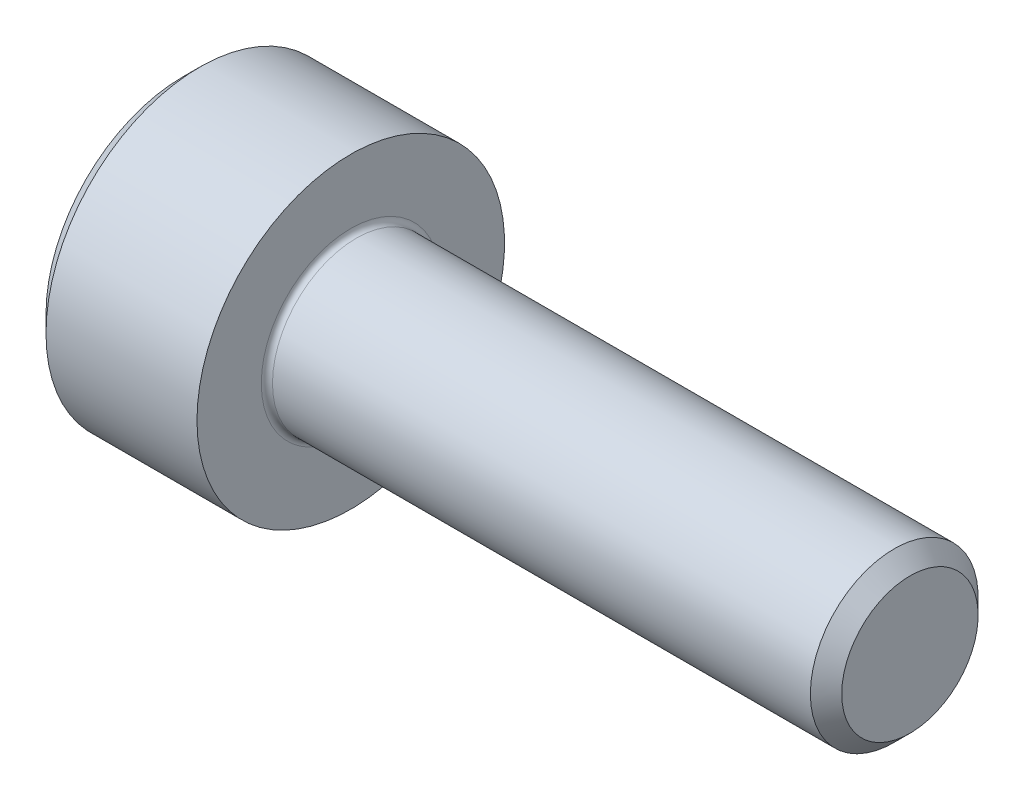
from build123d import *

# Parameters (mm, degrees)
FILLET1_R   = 0.1
HEX_2_DEPTH = 1.3


with BuildPart() as part:
    # BodySke → Base-Revolve (revolve)
    with BuildSketch(Plane.XY, mode=Mode.PRIVATE) as base_revolve_sk:
        Polygon((0, 0), (0, 2.45), (0.3, 2.75), (3, 2.75), (3, 1.5), (12.7195, 1.5), (13, 1.2195), (13, 0), align=None)
    revolve(base_revolve_sk.sketch.rotate(Axis((-31.75, 0, 0), (1, 0, 0)), 90), axis=Axis((-31.75, 0, 0), (1, 0, 0)))

    # Fillet1
    fillet1_edges = [part.edges().sort_by_distance(p)[0] for p in [
        (3, 0, -1.5),
    ]]
    fillet(fillet1_edges, radius=FILLET1_R)

    # Sketch2 → Hex-PreBroach (revolve, cut)
    with BuildSketch(Plane.XY, mode=Mode.PRIVATE) as hex_prebroach_sk:
        Polygon((0, 1.28), (1.3, 1.28), (2.039008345, 0), (0, 0), align=None)
    revolve(hex_prebroach_sk.sketch.rotate(Axis((0, 0, 0), (1, 0, 0)), 90), axis=Axis((0, 0, 0), (1, 0, 0)), mode=Mode.SUBTRACT)

    # Sketch3 → Hex 2 (cut)
    with BuildSketch(Plane(origin=(0, 0, 0), x_dir=(0, 0.500000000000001, 0.866025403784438), z_dir=(-1, 0, 0))):
        Polygon((0.739008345, 1.28), (-0.739008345, 1.28), (-1.478016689, 0), (-0.739008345, -1.28), (0.739008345, -1.28), (1.478016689, 0), align=None)
    extrude(amount=-HEX_2_DEPTH, mode=Mode.SUBTRACT)


solid = part.part
